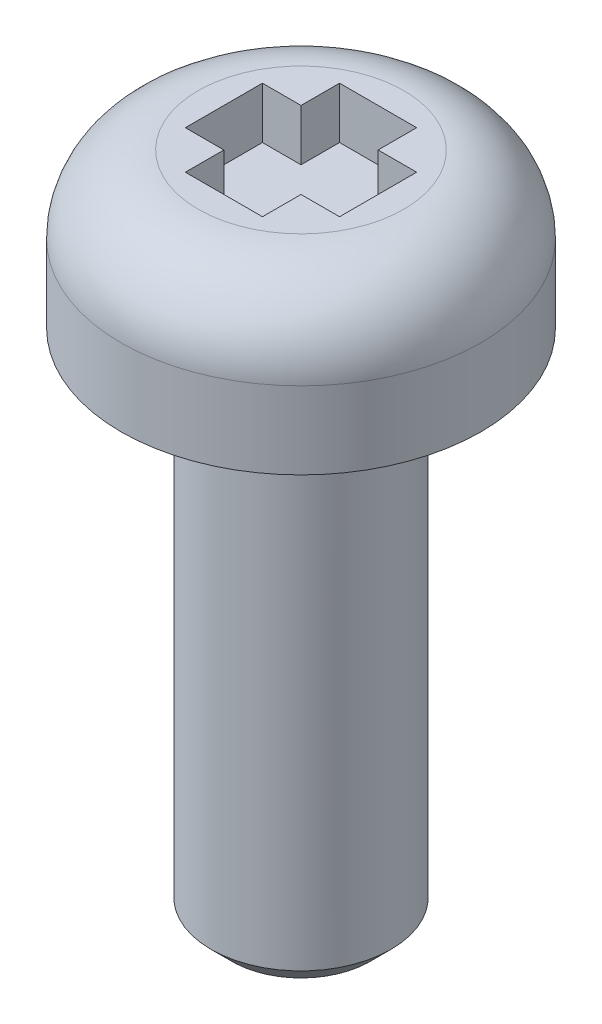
from build123d import *

# Parameters (mm, degrees)
SKETCH2_W               = 1.5
SKETCH2_H               = 3
CUT_EXTRUDE_THIN2_DEPTH = 1
CIRPATTERN1_COUNT       = 2
CIRPATTERN1_ANGLE       = 90
SKETCH3_R               = 1.75
BOSS_EXTRUDE1_DEPTH     = 10
FILLET1_R               = 0.4572
CHAMFER1_SIZE           = 0.4064


with BuildPart() as part:
    # Sketch1 → Base-Revolve (revolve)
    with BuildSketch(Plane.XY, mode=Mode.PRIVATE) as base_revolve_sk:
        with BuildLine():
            Line((3.5, 0), (0, 0))
            Line((0, 0), (0, 3))
            Line((0, 3), (2, 3))
            ThreePointArc((2, 3), (3.060660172, 2.560660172), (3.5, 1.5))
            Line((3.5, 1.5), (3.5, 0))
        make_face()
    revolve(base_revolve_sk.sketch.rotate(Axis((0, 11.592517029, 0), (0, -1, 0)), 90), axis=Axis((0, 11.592517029, 0), (0, -1, 0)))

    # Sketch2 → Cut-Extrude-Thin2 (cut)
    with BuildSketch(Plane(origin=(0, 3, 0), x_dir=(-1, 0, 0), z_dir=(0, 1, 0))):
        Rectangle(SKETCH2_W, SKETCH2_H)
    cut_extrude_thin2 = extrude(amount=-CUT_EXTRUDE_THIN2_DEPTH, mode=Mode.SUBTRACT)

    # CirPattern1: Cut-Extrude-Thin2 ×2 about axis
    cirpattern1_axis = Axis((0, 0, 0), (0, 1, 0))
    for i in range(1, CIRPATTERN1_COUNT):
        add(cut_extrude_thin2.rotate(cirpattern1_axis, i * CIRPATTERN1_ANGLE / (CIRPATTERN1_COUNT - 1)), mode=Mode.SUBTRACT)

    # Sketch3 → Boss-Extrude1 (add)
    with BuildSketch(Plane.XZ):
        with Locations(Location((0, 0, 0), (0, 0, 90))):
            Circle(SKETCH3_R)
    extrude(amount=BOSS_EXTRUDE1_DEPTH)

    # Fillet1
    fillet1_edges = [part.edges().sort_by_distance(p)[0] for p in [
        (0, 0, -1.75),
    ]]
    fillet(fillet1_edges, radius=FILLET1_R)

    # Chamfer1
    chamfer1_edges = [part.edges().sort_by_distance(p)[0] for p in [
        (0, -10, -1.75),
    ]]
    chamfer(chamfer1_edges, length=CHAMFER1_SIZE)


solid = part.part
